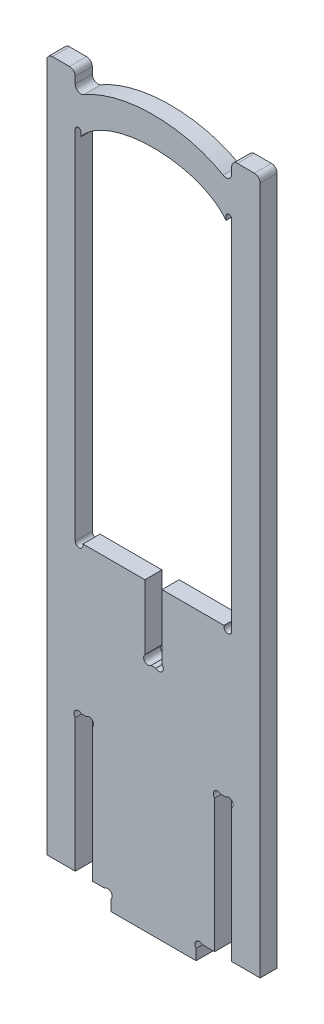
from build123d import *

# Parameters (mm, degrees)
EXTRUSION1_DEPTH        = 6
ESQUISSE2_W             = 0.012820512
ESQUISSE2_H             = 0.012820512
ESQUISSE2_W_2           = 0.012820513
ENL_V_MAT_EXTRU_2_DEPTH = 0.1


with BuildPart() as part:
    # Esquisse1 → Extrusion1 (new body)
    with BuildSketch(Plane.XY):
        with BuildLine():
            Line((16, 6), (20.307968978, 6))
            ThreePointArc((20.307968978, 6), (22.5, 6), (22.5, 3.807968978))
            Line((22.5, 3.807968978), (22.5, 0))
            Line((22.5, 0), (52.5, 0))
            Line((52.5, 0), (52.5, 3.807968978))
            ThreePointArc((52.5, 3.807968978), (52.5, 6), (54.692031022, 6))
            Line((54.692031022, 6), (59, 6))
            Line((59, 6), (59, 52.807968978))
            ThreePointArc((59, 52.807968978), (59, 55), (61.192031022, 55))
            Line((61.192031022, 55), (62.807968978, 55))
            ThreePointArc((62.807968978, 55), (65, 55), (65, 52.807968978))
            Line((65, 52.807968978), (65, 6))
            Line((65, 6), (75, 6))
            Line((75, 6), (75, 248))
            ThreePointArc((75, 248), (74.414213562, 249.414213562), (73, 250))
            Line((73, 250), (67, 250))
            ThreePointArc((67, 250), (65.585786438, 249.414213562), (65, 248))
            Line((65, 248), (65, 245.658812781))
            ThreePointArc((65, 245.658812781), (64, 243.926761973), (62, 243.926761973))
            add(Edge.make_bspline(
                [(62, 243.926761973), (37.5, 258.071843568), (13, 243.926761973)],
                knots=[0.857944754, 0.857944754, 0.857944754, 2.283647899, 2.283647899, 2.283647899], degree=2, weights=[1, 0.756500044, 1]))
            ThreePointArc((13, 243.926761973), (11, 243.926761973), (10, 245.658812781))
            Line((10, 245.658812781), (10, 248))
            ThreePointArc((10, 248), (9.414213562, 249.414213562), (8, 250))
            Line((8, 250), (2, 250))
            ThreePointArc((2, 250), (0.585786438, 249.414213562), (0, 248))
            Line((0, 248), (0, 6))
            Line((0, 6), (10, 6))
            Line((10, 6), (10, 52.807968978))
            ThreePointArc((10, 52.807968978), (10, 55), (12.192031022, 55))
            Line((12.192031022, 55), (13.807968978, 55))
            ThreePointArc((13.807968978, 55), (16, 55), (16, 52.807968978))
            Line((16, 52.807968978), (16, 6))
        make_face()
        with BuildLine():
            Line((38.307968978, 82), (36.692031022, 82))
            ThreePointArc((36.692031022, 82), (34.5, 82), (34.5, 84.192031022))
            Line((34.5, 84.192031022), (34.5, 107))
            Line((34.5, 107), (12.6997853, 107))
            Line((12.6997853, 107), (12.6997853, 106.5))
            ThreePointArc((12.6997853, 106.5), (11.34989265, 105.15010735), (10, 106.5))
            Line((10, 106.5), (10, 107))
            Line((10, 107), (10, 232))
            ThreePointArc((10, 232), (11, 233), (12, 232))
            Line((12, 232), (12, 230.613500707))
            add(Edge.make_bspline(
                [(63, 230.613500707), (37.5, 265.081940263), (12, 230.613500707)],
                knots=[0.383569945, 0.383569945, 0.383569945, 2.758022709, 2.758022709, 2.758022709], degree=2, weights=[1, 0.37423338, 1]))
            Line((63, 230.613500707), (63, 232))
            ThreePointArc((63, 232), (64, 233), (65, 232))
            Line((65, 232), (65, 107))
            Line((65, 107), (65, 106.5))
            ThreePointArc((65, 106.5), (63.65010735, 105.15010735), (62.3002147, 106.5))
            Line((62.3002147, 106.5), (62.3002147, 107))
            Line((62.3002147, 107), (40.5, 107))
            Line((40.5, 107), (40.5, 84.192031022))
            ThreePointArc((40.5, 84.192031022), (40.5, 82), (38.307968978, 82))
        make_face(mode=Mode.SUBTRACT)
    extrude(amount=EXTRUSION1_DEPTH)

    # Esquisse2 → Enl_v. mat.-Extru.2 (cut)
    # profile 1 of 9: a face of its own
    with BuildSketch(Plane.XY.offset(3)):
        with BuildLine():
            Line((0.05108938, 6.020248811), (0.028272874, 6.093325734))
            Line((0.028272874, 6.093325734), (0.04161422, 6.093325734))
            Line((0.04161422, 6.093325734), (0.053833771, 6.050737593))
            Line((0.053833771, 6.050737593), (0.057519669, 6.035453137))
            add(Edge.make_bspline(
                [(0.057519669, 6.035453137), (0.057552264, 6.035613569), (0.057643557, 6.036062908), (0.057856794, 6.036926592), (0.058121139, 6.038180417), (0.058513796, 6.039813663), (0.058996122, 6.041834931), (0.05955056, 6.04424699), (0.060193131, 6.047045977), (0.06065734, 6.049035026), (0.060905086, 6.050096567)],
                knots=[0, 0, 0, 0, 0.261394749, 0.732117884, 1.420242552, 2.307348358, 3.414248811, 4.738505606, 6.259362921, 8, 8, 8, 8], degree=3))
            Line((0.060905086, 6.050096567), (0.071722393, 6.093325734))
            Line((0.071722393, 6.093325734), (0.084983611, 6.093325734))
            Line((0.084983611, 6.093325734), (0.095740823, 6.050336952))
            Line((0.095740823, 6.050336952), (0.098785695, 6.036975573))
            Line((0.098785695, 6.036975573), (0.102591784, 6.050837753))
            Line((0.102591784, 6.050837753), (0.114891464, 6.093325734))
            Line((0.114891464, 6.093325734), (0.128272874, 6.093325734))
            Line((0.128272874, 6.093325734), (0.106618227, 6.020248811))
            Line((0.106618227, 6.020248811), (0.09171438, 6.020248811))
            Line((0.09171438, 6.020248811), (0.081277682, 6.063257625))
            Line((0.081277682, 6.063257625), (0.078272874, 6.076458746))
            Line((0.078272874, 6.076458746), (0.064811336, 6.020248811))
            Line((0.064811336, 6.020248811), (0.05108938, 6.020248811))
        make_face()
    # profile 2 of 9: a face of its own
    with BuildSketch(Plane.XY.offset(3)):
        with BuildLine():
            Line((0.149807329, 6.020248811), (0.126990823, 6.093325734))
            Line((0.126990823, 6.093325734), (0.140332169, 6.093325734))
            Line((0.140332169, 6.093325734), (0.15255172, 6.050737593))
            Line((0.15255172, 6.050737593), (0.156237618, 6.035453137))
            add(Edge.make_bspline(
                [(0.156237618, 6.035453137), (0.156270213, 6.035613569), (0.156361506, 6.036062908), (0.156574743, 6.036926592), (0.156839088, 6.038180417), (0.157231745, 6.039813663), (0.15771407, 6.041834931), (0.158268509, 6.04424699), (0.15891108, 6.047045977), (0.159375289, 6.049035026), (0.159623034, 6.050096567)],
                knots=[0, 0, 0, 0, 0.261394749, 0.732117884, 1.420242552, 2.307348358, 3.414248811, 4.738505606, 6.259362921, 8, 8, 8, 8], degree=3))
            Line((0.159623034, 6.050096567), (0.170440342, 6.093325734))
            Line((0.170440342, 6.093325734), (0.18370156, 6.093325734))
            Line((0.18370156, 6.093325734), (0.194458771, 6.050336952))
            Line((0.194458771, 6.050336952), (0.197503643, 6.036975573))
            Line((0.197503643, 6.036975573), (0.201309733, 6.050837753))
            Line((0.201309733, 6.050837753), (0.213609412, 6.093325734))
            Line((0.213609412, 6.093325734), (0.226990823, 6.093325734))
            Line((0.226990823, 6.093325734), (0.205336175, 6.020248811))
            Line((0.205336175, 6.020248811), (0.190432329, 6.020248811))
            Line((0.190432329, 6.020248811), (0.17999563, 6.063257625))
            Line((0.17999563, 6.063257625), (0.176990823, 6.076458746))
            Line((0.176990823, 6.076458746), (0.163529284, 6.020248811))
            Line((0.163529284, 6.020248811), (0.149807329, 6.020248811))
        make_face()
    # profile 3 of 9: a face of its own
    with BuildSketch(Plane.XY.offset(3)):
        with BuildLine():
            Line((0.248525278, 6.020248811), (0.225708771, 6.093325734))
            Line((0.225708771, 6.093325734), (0.239050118, 6.093325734))
            Line((0.239050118, 6.093325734), (0.251269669, 6.050737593))
            Line((0.251269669, 6.050737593), (0.254955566, 6.035453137))
            add(Edge.make_bspline(
                [(0.254955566, 6.035453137), (0.254988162, 6.035613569), (0.255079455, 6.036062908), (0.255292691, 6.036926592), (0.255557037, 6.038180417), (0.255949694, 6.039813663), (0.256432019, 6.041834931), (0.256986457, 6.04424699), (0.257629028, 6.047045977), (0.258093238, 6.049035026), (0.258340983, 6.050096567)],
                knots=[0, 0, 0, 0, 0.261394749, 0.732117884, 1.420242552, 2.307348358, 3.414248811, 4.738505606, 6.259362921, 8, 8, 8, 8], degree=3))
            Line((0.258340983, 6.050096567), (0.269158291, 6.093325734))
            Line((0.269158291, 6.093325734), (0.282419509, 6.093325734))
            Line((0.282419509, 6.093325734), (0.29317672, 6.050336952))
            Line((0.29317672, 6.050336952), (0.296221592, 6.036975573))
            Line((0.296221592, 6.036975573), (0.300027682, 6.050837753))
            Line((0.300027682, 6.050837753), (0.312327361, 6.093325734))
            Line((0.312327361, 6.093325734), (0.325708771, 6.093325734))
            Line((0.325708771, 6.093325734), (0.304054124, 6.020248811))
            Line((0.304054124, 6.020248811), (0.289150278, 6.020248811))
            Line((0.289150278, 6.020248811), (0.278713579, 6.063257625))
            Line((0.278713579, 6.063257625), (0.275708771, 6.076458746))
            Line((0.275708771, 6.076458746), (0.262247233, 6.020248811))
            Line((0.262247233, 6.020248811), (0.248525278, 6.020248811))
        make_face()
    # profile 4 of 9: a face of its own
    with BuildSketch(Plane.XY.offset(3)):
        with Locations((0.344298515, 6.026659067)):
            Rectangle(ESQUISSE2_W, ESQUISSE2_H)
    # profile 5 of 9: a face of its own
    with BuildSketch(Plane.XY.offset(3)):
        with BuildLine():
            add(Edge.make_bspline(
                [(0.418657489, 6.02922317), (0.417533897, 6.028339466), (0.415369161, 6.026636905), (0.412062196, 6.02443319), (0.408866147, 6.022618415), (0.405717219, 6.021230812), (0.402556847, 6.02021953), (0.399332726, 6.019498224), (0.395994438, 6.019039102), (0.393725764, 6.018991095), (0.392575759, 6.018966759)],
                knots=[0, 0, 0, 0, 1.197047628, 2.306255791, 3.325459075, 4.272204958, 5.183179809, 6.100503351, 7.037132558, 8, 8, 8, 8], degree=3))
            add(Edge.make_bspline(
                [(0.392575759, 6.018966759), (0.391640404, 6.018988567), (0.389826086, 6.019030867), (0.387184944, 6.019283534), (0.384712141, 6.019744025), (0.382403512, 6.020390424), (0.3802428, 6.021175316), (0.37826843, 6.022192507), (0.376453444, 6.02337044), (0.374830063, 6.024740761), (0.373391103, 6.026247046), (0.372116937, 6.027849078), (0.371053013, 6.029568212), (0.370162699, 6.031375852), (0.369476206, 6.033297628), (0.369002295, 6.035320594), (0.368717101, 6.037441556), (0.368677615, 6.038884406), (0.368657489, 6.039619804)],
                knots=[0, 0, 0, 0, 1.258692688, 2.441500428, 3.565802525, 4.638326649, 5.664695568, 6.653201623, 7.620115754, 8.570354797, 9.504485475, 10.41940588, 11.319425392, 12.219534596, 13.126122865, 14.058869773, 15.010636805, 16, 16, 16, 16], degree=3))
            add(Edge.make_bspline(
                [(0.368657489, 6.039619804), (0.368681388, 6.040489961), (0.368728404, 6.042201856), (0.369191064, 6.044702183), (0.369903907, 6.047090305), (0.370936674, 6.049328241), (0.372189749, 6.05140318), (0.373646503, 6.053280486), (0.375264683, 6.05495918), (0.377096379, 6.05638423), (0.37906171, 6.057614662), (0.381140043, 6.058710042), (0.383340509, 6.059631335), (0.384872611, 6.060111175), (0.385644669, 6.060352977)],
                knots=[0, 0, 0, 0, 1.081160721, 2.127011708, 3.15154375, 4.173548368, 5.183333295, 6.160067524, 7.123185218, 8.075175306, 9.03822139, 10.004020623, 10.994184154, 12, 12, 12, 12], degree=3))
            add(Edge.make_bspline(
                [(0.385644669, 6.060352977), (0.386297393, 6.060520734), (0.387746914, 6.060893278), (0.390167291, 6.061322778), (0.393022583, 6.061797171), (0.395078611, 6.062056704), (0.396181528, 6.062195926)],
                knots=[0, 0, 0, 0, 0.755247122, 1.677198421, 2.753978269, 4, 4, 4, 4], degree=3))
            add(Edge.make_bspline(
                [(0.396181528, 6.062195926), (0.397336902, 6.062347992), (0.399568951, 6.062641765), (0.402804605, 6.063092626), (0.405802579, 6.063593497), (0.408564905, 6.064120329), (0.411096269, 6.064624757), (0.413378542, 6.065191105), (0.415432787, 6.065763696), (0.416709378, 6.066196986), (0.417315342, 6.066402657)],
                knots=[0, 0, 0, 0, 1.295688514, 2.50312072, 3.632112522, 4.674678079, 5.629835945, 6.501350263, 7.28863104, 8, 8, 8, 8], degree=3))
            add(Edge.make_bspline(
                [(0.417315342, 6.066402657), (0.417322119, 6.066756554), (0.417334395, 6.067397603), (0.417349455, 6.068252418), (0.417378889, 6.068893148), (0.417376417, 6.069247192), (0.417375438, 6.069387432)],
                knots=[0, 0, 0, 0, 1.422721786, 2.577112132, 3.436380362, 4, 4, 4, 4], degree=3))
            add(Edge.make_bspline(
                [(0.417375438, 6.069387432), (0.417360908, 6.069948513), (0.417333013, 6.07102571), (0.417204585, 6.072581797), (0.416940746, 6.074008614), (0.416585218, 6.075310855), (0.416134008, 6.07649118), (0.415536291, 6.077512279), (0.414883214, 6.078444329), (0.414340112, 6.078951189), (0.41407015, 6.079203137)],
                knots=[0, 0, 0, 0, 1.26154989, 2.42199954, 3.505345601, 4.517638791, 5.454101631, 6.334651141, 7.172195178, 8, 8, 8, 8], degree=3))
            add(Edge.make_bspline(
                [(0.41407015, 6.079203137), (0.413684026, 6.079515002), (0.412894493, 6.080152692), (0.411535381, 6.080910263), (0.410078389, 6.08160518), (0.408469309, 6.082143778), (0.406732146, 6.082557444), (0.404857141, 6.082855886), (0.402849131, 6.083037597), (0.401463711, 6.083058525), (0.400748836, 6.083069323)],
                knots=[0, 0, 0, 0, 0.839762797, 1.717118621, 2.62848608, 3.573318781, 4.586191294, 5.652292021, 6.78858503, 8, 8, 8, 8], degree=3))
            add(Edge.make_bspline(
                [(0.400748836, 6.083069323), (0.400080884, 6.083062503), (0.398797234, 6.083049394), (0.396932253, 6.08292494), (0.395206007, 6.082733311), (0.393606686, 6.082452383), (0.392155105, 6.08209513), (0.390823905, 6.081674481), (0.389631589, 6.081164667), (0.388214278, 6.080345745), (0.386619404, 6.079033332), (0.385057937, 6.076955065), (0.383687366, 6.07444673), (0.383080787, 6.072539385), (0.382760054, 6.071530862)],
                knots=[0, 0, 0, 0, 1.022193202, 1.964420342, 2.859404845, 3.679355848, 4.447752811, 5.145854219, 5.814144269, 6.427678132, 7.647232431, 8.943346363, 10.383770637, 12, 12, 12, 12], degree=3))
            Line((0.382760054, 6.071530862), (0.369939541, 6.072812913))
            add(Edge.make_bspline(
                [(0.369939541, 6.072812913), (0.370233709, 6.074015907), (0.370801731, 6.076338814), (0.372051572, 6.079578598), (0.373564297, 6.082455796), (0.37533658, 6.085024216), (0.377515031, 6.087239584), (0.380070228, 6.089189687), (0.383068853, 6.09081549), (0.386448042, 6.092194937), (0.390181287, 6.093282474), (0.394225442, 6.09405546), (0.398547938, 6.094517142), (0.401522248, 6.094576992), (0.403052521, 6.094607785)],
                knots=[0, 0, 0, 0, 1.021253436, 1.971977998, 2.856928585, 3.699335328, 4.537187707, 5.410097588, 6.342486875, 7.343316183, 8.417452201, 9.545747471, 10.737294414, 12, 12, 12, 12], degree=3))
            add(Edge.make_bspline(
                [(0.403052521, 6.094607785), (0.404549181, 6.094581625), (0.407401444, 6.094531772), (0.411455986, 6.09414073), (0.415076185, 6.093476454), (0.418253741, 6.092514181), (0.42101592, 6.091343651), (0.423400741, 6.090055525), (0.425397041, 6.088607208), (0.427024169, 6.086989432), (0.428329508, 6.085179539), (0.429384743, 6.083177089), (0.430266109, 6.080969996), (0.43065563, 6.079395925), (0.430857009, 6.078582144)],
                knots=[0, 0, 0, 0, 1.532418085, 2.920410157, 4.166262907, 5.295392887, 6.3126657, 7.233843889, 8.065362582, 8.82930282, 9.573337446, 10.341184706, 11.142406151, 12, 12, 12, 12], degree=3))
            add(Edge.make_bspline(
                [(0.430857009, 6.078582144), (0.430960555, 6.077962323), (0.431198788, 6.076536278), (0.431331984, 6.074082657), (0.431465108, 6.071051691), (0.431473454, 6.068833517), (0.431478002, 6.067624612)],
                knots=[0, 0, 0, 0, 0.685842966, 1.577944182, 2.67997895, 4, 4, 4, 4], degree=3))
            Line((0.431478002, 6.067624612), (0.431478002, 6.05197958))
            add(Edge.make_bspline(
                [(0.431478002, 6.05197958), (0.431485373, 6.050670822), (0.431499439, 6.048173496), (0.431508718, 6.044600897), (0.431563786, 6.04138185), (0.431675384, 6.038504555), (0.431767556, 6.035973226), (0.431878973, 6.033781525), (0.432037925, 6.031944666), (0.432273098, 6.029961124), (0.432683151, 6.027736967), (0.433377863, 6.025185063), (0.4342221, 6.022670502), (0.434956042, 6.021057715), (0.435324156, 6.020248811)],
                knots=[0, 0, 0, 0, 1.460752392, 2.787357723, 3.987454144, 5.053844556, 6.001073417, 6.814649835, 7.502887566, 8.058452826, 9.043678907, 10.023506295, 11.008675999, 12, 12, 12, 12], degree=3))
            Line((0.435324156, 6.020248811), (0.422503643, 6.020248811))
            add(Edge.make_bspline(
                [(0.422503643, 6.020248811), (0.422029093, 6.020904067), (0.421080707, 6.022213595), (0.420019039, 6.024417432), (0.419144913, 6.026744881), (0.418821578, 6.028388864), (0.418657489, 6.02922317)],
                knots=[0, 0, 0, 0, 0.98283144, 1.964183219, 2.966842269, 4, 4, 4, 4], degree=3))
        make_face()
        with BuildLine():
            add(Edge.make_bspline(
                [(0.417375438, 6.054864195), (0.416810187, 6.054663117), (0.415617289, 6.054238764), (0.413693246, 6.053727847), (0.411591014, 6.053166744), (0.409272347, 6.052684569), (0.406765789, 6.052173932), (0.404044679, 6.051720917), (0.401132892, 6.051281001), (0.399120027, 6.05101477), (0.398084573, 6.050877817)],
                knots=[0, 0, 0, 0, 0.729352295, 1.539213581, 2.419656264, 3.375381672, 4.41857158, 5.530700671, 6.729748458, 8, 8, 8, 8], degree=3))
            add(Edge.make_bspline(
                [(0.398084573, 6.050877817), (0.396954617, 6.050727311), (0.394869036, 6.050449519), (0.392022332, 6.049930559), (0.389705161, 6.049401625), (0.38785362, 6.048842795), (0.386349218, 6.04818391), (0.38510306, 6.047365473), (0.38399866, 6.046447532), (0.383101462, 6.04537365), (0.382368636, 6.044219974), (0.381874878, 6.042973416), (0.381526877, 6.04168196), (0.381494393, 6.040790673), (0.381478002, 6.040340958)],
                knots=[0, 0, 0, 0, 1.886220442, 3.481434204, 4.78676141, 5.817751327, 6.678319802, 7.493641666, 8.277504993, 9.045791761, 9.800124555, 10.528599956, 11.257578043, 12, 12, 12, 12], degree=3))
            add(Edge.make_bspline(
                [(0.381478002, 6.040340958), (0.38151577, 6.039659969), (0.381589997, 6.038321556), (0.382320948, 6.036429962), (0.383458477, 6.034719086), (0.385040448, 6.033206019), (0.387077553, 6.031983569), (0.389532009, 6.03110545), (0.392388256, 6.030599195), (0.394423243, 6.030537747), (0.395500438, 6.030505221)],
                knots=[0, 0, 0, 0, 0.849267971, 1.669148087, 2.501462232, 3.405991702, 4.385156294, 5.453560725, 6.652073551, 8, 8, 8, 8], degree=3))
            add(Edge.make_bspline(
                [(0.395500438, 6.030505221), (0.396605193, 6.030534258), (0.39877076, 6.030591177), (0.401917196, 6.031203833), (0.404890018, 6.032129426), (0.407622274, 6.033465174), (0.41009103, 6.03504717), (0.4122282, 6.036839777), (0.414048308, 6.038794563), (0.414960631, 6.040271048), (0.415412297, 6.041002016)],
                knots=[0, 0, 0, 0, 1.124426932, 2.204129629, 3.254288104, 4.289056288, 5.293189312, 6.235005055, 7.126199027, 8, 8, 8, 8], degree=3))
            add(Edge.make_bspline(
                [(0.415412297, 6.041002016), (0.415716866, 6.041634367), (0.416371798, 6.042994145), (0.416887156, 6.045375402), (0.417264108, 6.04812086), (0.41729751, 6.05008804), (0.417315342, 6.051138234)],
                knots=[0, 0, 0, 0, 0.806621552, 1.73452216, 2.790557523, 4, 4, 4, 4], degree=3))
            Line((0.417315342, 6.051138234), (0.417375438, 6.054864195))
        make_face(mode=Mode.SUBTRACT)
    # profile 6 of 9: a face of its own
    with BuildSketch(Plane.XY.offset(3)):
        Polygon((0.485324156, 6.020248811), (0.485324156, 6.044607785), (0.441734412, 6.044607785), (0.441734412, 6.057428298), (0.48917031, 6.118966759), (0.498144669, 6.118966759), (0.498144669, 6.057428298), (0.510965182, 6.057428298), (0.510965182, 6.044607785), (0.498144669, 6.044607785), (0.498144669, 6.020248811), align=None)
        Polygon((0.485324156, 6.057428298), (0.485324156, 6.093445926), (0.457559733, 6.057428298), align=None, mode=Mode.SUBTRACT)
    # profile 7 of 9: a face of its own
    with BuildSketch(Plane.XY.offset(3)):
        with Locations((0.536606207, 6.026659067)):
            Rectangle(ESQUISSE2_W_2, ESQUISSE2_H)
    # profile 8 of 9: a face of its own
    with BuildSketch(Plane.XY.offset(3)):
        with BuildLine():
            Line((0.567876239, 6.020248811), (0.567876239, 6.081787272))
            Line((0.567876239, 6.081787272), (0.557619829, 6.081787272))
            Line((0.557619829, 6.081787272), (0.557619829, 6.093325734))
            Line((0.557619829, 6.093325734), (0.567876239, 6.093325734))
            Line((0.567876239, 6.093325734), (0.567876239, 6.100757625))
            add(Edge.make_bspline(
                [(0.567876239, 6.100757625), (0.567886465, 6.101853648), (0.567905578, 6.103902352), (0.568173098, 6.106744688), (0.56854369, 6.109162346), (0.569020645, 6.11057112), (0.569238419, 6.111214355)],
                knots=[0, 0, 0, 0, 1.240410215, 2.318594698, 3.232283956, 4, 4, 4, 4], degree=3))
            add(Edge.make_bspline(
                [(0.569238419, 6.111214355), (0.569580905, 6.111956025), (0.570268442, 6.113444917), (0.571762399, 6.11544535), (0.573623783, 6.1171968), (0.575802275, 6.118759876), (0.578378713, 6.120046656), (0.581394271, 6.120895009), (0.584796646, 6.121443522), (0.587204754, 6.121500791), (0.588469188, 6.121530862)],
                knots=[0, 0, 0, 0, 0.841887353, 1.690076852, 2.558213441, 3.472839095, 4.450413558, 5.515111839, 6.695250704, 8, 8, 8, 8], degree=3))
            add(Edge.make_bspline(
                [(0.588469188, 6.121530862), (0.589351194, 6.121515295), (0.591158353, 6.121483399), (0.593930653, 6.121218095), (0.596842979, 6.120855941), (0.598814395, 6.120468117), (0.599827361, 6.120268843)],
                knots=[0, 0, 0, 0, 0.924505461, 1.89423605, 2.918002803, 4, 4, 4, 4], degree=3))
            Line((0.599827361, 6.120268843), (0.598004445, 6.109351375))
            add(Edge.make_bspline(
                [(0.598004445, 6.109351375), (0.596778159, 6.109538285), (0.59440076, 6.109900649), (0.591996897, 6.109962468), (0.59083297, 6.1099924)],
                knots=[0, 0, 0, 0, 1.031619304, 2, 2, 2, 2], degree=3))
            add(Edge.make_bspline(
                [(0.59083297, 6.1099924), (0.589976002, 6.109970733), (0.588383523, 6.109930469), (0.586193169, 6.109511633), (0.58437066, 6.108854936), (0.582916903, 6.10783645), (0.581854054, 6.10638413), (0.581190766, 6.104489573), (0.580750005, 6.10216012), (0.580715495, 6.100446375), (0.580696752, 6.099515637)],
                knots=[0, 0, 0, 0, 1.201235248, 2.232219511, 3.116244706, 3.901648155, 4.685036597, 5.598662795, 6.695829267, 8, 8, 8, 8], degree=3))
            Line((0.580696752, 6.099515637), (0.580696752, 6.093325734))
            Line((0.580696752, 6.093325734), (0.593517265, 6.093325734))
            Line((0.593517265, 6.093325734), (0.593517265, 6.081787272))
            Line((0.593517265, 6.081787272), (0.580696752, 6.081787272))
            Line((0.580696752, 6.081787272), (0.580696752, 6.020248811))
            Line((0.580696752, 6.020248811), (0.567876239, 6.020248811))
        make_face()
    # profile 9 of 9: a face of its own
    with BuildSketch(Plane.XY.offset(3)):
        with BuildLine():
            Line((0.603272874, 6.020248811), (0.603272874, 6.093325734))
            Line((0.603272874, 6.093325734), (0.614811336, 6.093325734))
            Line((0.614811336, 6.093325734), (0.614811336, 6.08312942))
            add(Edge.make_bspline(
                [(0.614811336, 6.08312942), (0.615456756, 6.084207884), (0.616652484, 6.086205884), (0.618538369, 6.088838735), (0.620332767, 6.090900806), (0.622144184, 6.092370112), (0.623956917, 6.09338699), (0.625807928, 6.094087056), (0.627744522, 6.094531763), (0.629065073, 6.094582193), (0.629735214, 6.094607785)],
                knots=[0, 0, 0, 0, 1.517336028, 2.811068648, 3.907416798, 4.807929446, 5.613162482, 6.406966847, 7.191583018, 8, 8, 8, 8], degree=3))
            add(Edge.make_bspline(
                [(0.629735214, 6.094607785), (0.630727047, 6.094563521), (0.632737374, 6.094473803), (0.635749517, 6.093785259), (0.638797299, 6.09274133), (0.640738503, 6.091710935), (0.641734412, 6.091182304)],
                knots=[0, 0, 0, 0, 0.943117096, 1.911585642, 2.928565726, 4, 4, 4, 4], degree=3))
            Line((0.641734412, 6.091182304), (0.637728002, 6.080064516))
            add(Edge.make_bspline(
                [(0.637728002, 6.080064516), (0.637032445, 6.08052698), (0.635690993, 6.081418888), (0.633540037, 6.082363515), (0.631390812, 6.082966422), (0.629945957, 6.083035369), (0.629234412, 6.083069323)],
                knots=[0, 0, 0, 0, 1.093324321, 2.108587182, 3.068540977, 4, 4, 4, 4], degree=3))
            add(Edge.make_bspline(
                [(0.629234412, 6.083069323), (0.628617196, 6.083037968), (0.627398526, 6.082976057), (0.625617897, 6.082495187), (0.623942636, 6.081700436), (0.622374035, 6.080616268), (0.620978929, 6.079245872), (0.619754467, 6.077643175), (0.618764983, 6.075780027), (0.618310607, 6.074416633), (0.61807656, 6.073714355)],
                knots=[0, 0, 0, 0, 0.946345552, 1.868524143, 2.808299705, 3.780481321, 4.780563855, 5.797153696, 6.865325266, 8, 8, 8, 8], degree=3))
            add(Edge.make_bspline(
                [(0.61807656, 6.073714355), (0.617770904, 6.072576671), (0.617150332, 6.07026684), (0.616554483, 6.066672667), (0.616151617, 6.062926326), (0.61611307, 6.06037415), (0.616093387, 6.059070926)],
                knots=[0, 0, 0, 0, 0.953038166, 1.934944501, 2.945515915, 4, 4, 4, 4], degree=3))
            Line((0.616093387, 6.059070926), (0.616093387, 6.020248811))
            Line((0.616093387, 6.020248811), (0.603272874, 6.020248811))
        make_face()
    extrude(amount=-ENL_V_MAT_EXTRU_2_DEPTH, mode=Mode.SUBTRACT)


solid = part.part
